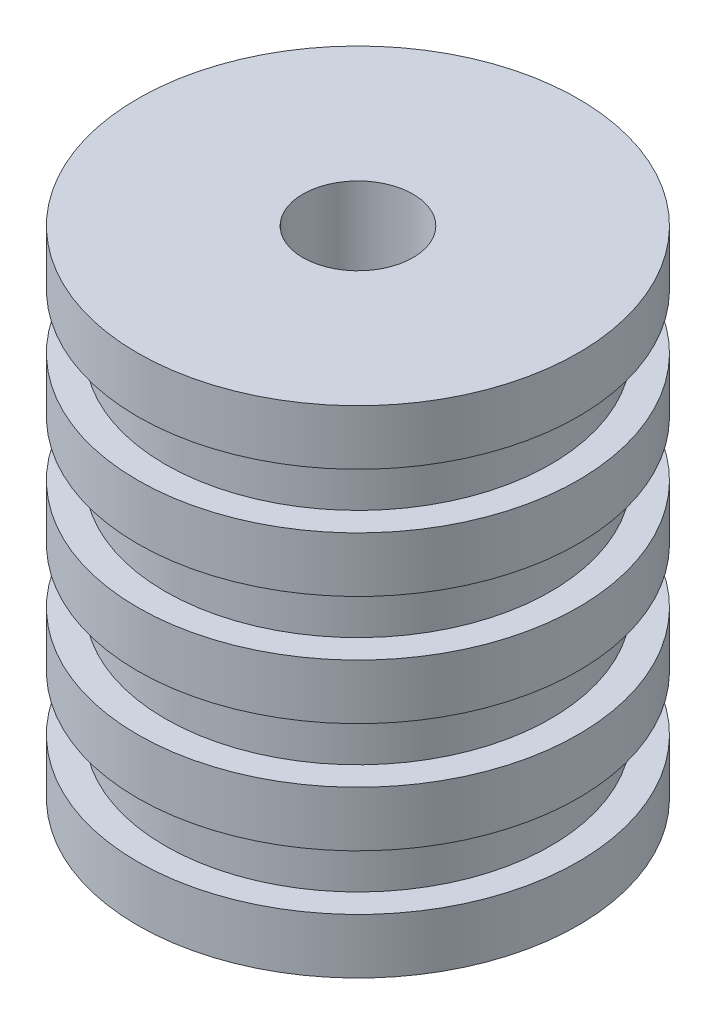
ISO-10303-21;
HEADER;
FILE_DESCRIPTION(('STEP AP214'),'2;1');
FILE_NAME('part.step','',(''),(''),'','','');
FILE_SCHEMA(('AUTOMOTIVE_DESIGN { 1 0 10303 214 1 1 1 1 }'));
ENDSEC;
DATA;
#1=APPLICATION_CONTEXT('core data for automotive mechanical design processes');
#2=APPLICATION_PROTOCOL_DEFINITION('international standard','automotive_design',2000,#1);
#3=PRODUCT_CONTEXT('',#1,'mechanical');
#4=PRODUCT('Part','Part','',(#3));
#5=PRODUCT_RELATED_PRODUCT_CATEGORY('part','',(#4));
#6=PRODUCT_DEFINITION_FORMATION('','',#4);
#7=PRODUCT_DEFINITION_CONTEXT('part definition',#1,'design');
#8=PRODUCT_DEFINITION('design','',#6,#7);
#9=PRODUCT_DEFINITION_SHAPE('','',#8);
#10=(LENGTH_UNIT() NAMED_UNIT(*) SI_UNIT(.MILLI.,.METRE.));
#11=(NAMED_UNIT(*) PLANE_ANGLE_UNIT() SI_UNIT($,.RADIAN.));
#12=(NAMED_UNIT(*) SI_UNIT($,.STERADIAN.) SOLID_ANGLE_UNIT());
#13=UNCERTAINTY_MEASURE_WITH_UNIT(LENGTH_MEASURE(1.E-05),#10,'distance_accuracy_value','');
#14=(GEOMETRIC_REPRESENTATION_CONTEXT(3) GLOBAL_UNCERTAINTY_ASSIGNED_CONTEXT((#13)) GLOBAL_UNIT_ASSIGNED_CONTEXT((#10,
#11,#12)) REPRESENTATION_CONTEXT('',''));
#15=CARTESIAN_POINT('',(0.,0.,0.));
#16=DIRECTION('',(0.,0.,1.));
#17=DIRECTION('',(1.,0.,0.));
#18=AXIS2_PLACEMENT_3D('',#15,#16,#17);
#19=CARTESIAN_POINT('',(0.,0.,0.));
#20=DIRECTION('',(0.,1.,0.));
#21=DIRECTION('',(0.,0.,1.));
#22=AXIS2_PLACEMENT_3D('',#19,#20,#21);
#23=CYLINDRICAL_SURFACE('',#22,80.);
#24=CARTESIAN_POINT('',(0.,0.,0.));
#25=DIRECTION('',(0.,1.,0.));
#26=DIRECTION('',(0.,0.,1.));
#27=AXIS2_PLACEMENT_3D('',#24,#25,#26);
#28=CIRCLE('',#27,80.);
#29=CARTESIAN_POINT('',(0.,0.,80.));
#30=VERTEX_POINT('',#29);
#31=EDGE_CURVE('E10',#30,#30,#28,.T.);
#32=ORIENTED_EDGE('',*,*,#31,.F.);
#33=EDGE_LOOP('',(#32));
#34=FACE_BOUND('',#33,.T.);
#35=CARTESIAN_POINT('',(0.,-20.,0.));
#36=DIRECTION('',(0.,1.,0.));
#37=DIRECTION('',(0.,0.,1.));
#38=AXIS2_PLACEMENT_3D('',#35,#36,#37);
#39=CIRCLE('',#38,80.);
#40=CARTESIAN_POINT('',(0.,-20.,80.));
#41=VERTEX_POINT('',#40);
#42=EDGE_CURVE('E410',#41,#41,#39,.T.);
#43=ORIENTED_EDGE('',*,*,#42,.T.);
#44=EDGE_LOOP('',(#43));
#45=FACE_BOUND('',#44,.T.);
#46=ADVANCED_FACE('F346',(#34,#45),#23,.T.);
#47=CARTESIAN_POINT('',(20.000000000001,0.,0.));
#48=DIRECTION('',(0.,-1.,0.));
#49=DIRECTION('',(0.,0.,-1.));
#50=AXIS2_PLACEMENT_3D('',#47,#48,#49);
#51=PLANE('',#50);
#52=CARTESIAN_POINT('',(0.,0.,0.));
#53=DIRECTION('',(0.,1.,0.));
#54=DIRECTION('',(0.,0.,1.));
#55=AXIS2_PLACEMENT_3D('',#52,#53,#54);
#56=CIRCLE('',#55,20.000000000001);
#57=CARTESIAN_POINT('',(0.,0.,20.000000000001));
#58=VERTEX_POINT('',#57);
#59=EDGE_CURVE('E352',#58,#58,#56,.T.);
#60=ORIENTED_EDGE('',*,*,#59,.F.);
#61=EDGE_LOOP('',(#60));
#62=FACE_BOUND('',#61,.T.);
#63=ORIENTED_EDGE('',*,*,#31,.T.);
#64=EDGE_LOOP('',(#63));
#65=FACE_BOUND('',#64,.T.);
#66=ADVANCED_FACE('F519',(#62,#65),#51,.F.);
#67=CARTESIAN_POINT('',(0.,0.,0.));
#68=DIRECTION('',(0.,1.,0.));
#69=DIRECTION('',(0.,0.,1.));
#70=AXIS2_PLACEMENT_3D('',#67,#68,#69);
#71=CYLINDRICAL_SURFACE('',#70,20.000000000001);
#72=CARTESIAN_POINT('',(0.,-180.,0.));
#73=DIRECTION('',(0.,1.,0.));
#74=DIRECTION('',(0.,0.,1.));
#75=AXIS2_PLACEMENT_3D('',#72,#73,#74);
#76=CIRCLE('',#75,20.000000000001);
#77=CARTESIAN_POINT('',(0.,-180.,20.000000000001));
#78=VERTEX_POINT('',#77);
#79=EDGE_CURVE('E356',#78,#78,#76,.T.);
#80=ORIENTED_EDGE('',*,*,#79,.F.);
#81=EDGE_LOOP('',(#80));
#82=FACE_BOUND('',#81,.T.);
#83=ORIENTED_EDGE('',*,*,#59,.T.);
#84=EDGE_LOOP('',(#83));
#85=FACE_BOUND('',#84,.T.);
#86=ADVANCED_FACE('F514',(#82,#85),#71,.F.);
#87=CARTESIAN_POINT('',(80.0000000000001,-180.,0.));
#88=DIRECTION('',(0.,1.,0.));
#89=DIRECTION('',(0.,0.,1.));
#90=AXIS2_PLACEMENT_3D('',#87,#88,#89);
#91=PLANE('',#90);
#92=CARTESIAN_POINT('',(0.,-180.,0.));
#93=DIRECTION('',(0.,1.,0.));
#94=DIRECTION('',(0.,0.,1.));
#95=AXIS2_PLACEMENT_3D('',#92,#93,#94);
#96=CIRCLE('',#95,80.0000000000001);
#97=CARTESIAN_POINT('',(0.,-180.,80.0000000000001));
#98=VERTEX_POINT('',#97);
#99=EDGE_CURVE('E360',#98,#98,#96,.T.);
#100=ORIENTED_EDGE('',*,*,#99,.F.);
#101=EDGE_LOOP('',(#100));
#102=FACE_BOUND('',#101,.T.);
#103=ORIENTED_EDGE('',*,*,#79,.T.);
#104=EDGE_LOOP('',(#103));
#105=FACE_BOUND('',#104,.T.);
#106=ADVANCED_FACE('F508',(#102,#105),#91,.F.);
#107=CARTESIAN_POINT('',(0.,0.,0.));
#108=DIRECTION('',(0.,1.,0.));
#109=DIRECTION('',(0.,0.,1.));
#110=AXIS2_PLACEMENT_3D('',#107,#108,#109);
#111=CYLINDRICAL_SURFACE('',#110,80.0000000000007);
#112=CARTESIAN_POINT('',(0.,-160.,0.));
#113=DIRECTION('',(0.,1.,0.));
#114=DIRECTION('',(0.,0.,1.));
#115=AXIS2_PLACEMENT_3D('',#112,#113,#114);
#116=CIRCLE('',#115,80.0000000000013);
#117=CARTESIAN_POINT('',(0.,-160.,80.0000000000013));
#118=VERTEX_POINT('',#117);
#119=EDGE_CURVE('E365',#118,#118,#116,.T.);
#120=ORIENTED_EDGE('',*,*,#119,.F.);
#121=EDGE_LOOP('',(#120));
#122=FACE_BOUND('',#121,.T.);
#123=ORIENTED_EDGE('',*,*,#99,.T.);
#124=EDGE_LOOP('',(#123));
#125=FACE_BOUND('',#124,.T.);
#126=ADVANCED_FACE('F502',(#122,#125),#111,.T.);
#127=CARTESIAN_POINT('',(70.0000000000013,-160.,0.));
#128=DIRECTION('',(0.,-1.,0.));
#129=DIRECTION('',(0.,0.,-1.));
#130=AXIS2_PLACEMENT_3D('',#127,#128,#129);
#131=PLANE('',#130);
#132=CARTESIAN_POINT('',(0.,-160.,0.));
#133=DIRECTION('',(0.,1.,0.));
#134=DIRECTION('',(0.,0.,1.));
#135=AXIS2_PLACEMENT_3D('',#132,#133,#134);
#136=CIRCLE('',#135,70.0000000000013);
#137=CARTESIAN_POINT('',(0.,-160.,70.0000000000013));
#138=VERTEX_POINT('',#137);
#139=EDGE_CURVE('E368',#138,#138,#136,.T.);
#140=ORIENTED_EDGE('',*,*,#139,.F.);
#141=EDGE_LOOP('',(#140));
#142=FACE_BOUND('',#141,.T.);
#143=ORIENTED_EDGE('',*,*,#119,.T.);
#144=EDGE_LOOP('',(#143));
#145=FACE_BOUND('',#144,.T.);
#146=ADVANCED_FACE('F496',(#142,#145),#131,.F.);
#147=CARTESIAN_POINT('',(0.,0.,0.));
#148=DIRECTION('',(0.,1.,0.));
#149=DIRECTION('',(0.,0.,1.));
#150=AXIS2_PLACEMENT_3D('',#147,#148,#149);
#151=CYLINDRICAL_SURFACE('',#150,70.0000000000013);
#152=CARTESIAN_POINT('',(0.,-140.,0.));
#153=DIRECTION('',(0.,1.,0.));
#154=DIRECTION('',(0.,0.,1.));
#155=AXIS2_PLACEMENT_3D('',#152,#153,#154);
#156=CIRCLE('',#155,70.0000000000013);
#157=CARTESIAN_POINT('',(0.,-140.,70.0000000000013));
#158=VERTEX_POINT('',#157);
#159=EDGE_CURVE('E371',#158,#158,#156,.T.);
#160=ORIENTED_EDGE('',*,*,#159,.F.);
#161=EDGE_LOOP('',(#160));
#162=FACE_BOUND('',#161,.T.);
#163=ORIENTED_EDGE('',*,*,#139,.T.);
#164=EDGE_LOOP('',(#163));
#165=FACE_BOUND('',#164,.T.);
#166=ADVANCED_FACE('F490',(#162,#165),#151,.T.);
#167=CARTESIAN_POINT('',(80.0000000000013,-140.,0.));
#168=DIRECTION('',(0.,1.,0.));
#169=DIRECTION('',(0.,0.,1.));
#170=AXIS2_PLACEMENT_3D('',#167,#168,#169);
#171=PLANE('',#170);
#172=CARTESIAN_POINT('',(0.,-140.,0.));
#173=DIRECTION('',(0.,1.,0.));
#174=DIRECTION('',(0.,0.,1.));
#175=AXIS2_PLACEMENT_3D('',#172,#173,#174);
#176=CIRCLE('',#175,80.0000000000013);
#177=CARTESIAN_POINT('',(0.,-140.,80.0000000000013));
#178=VERTEX_POINT('',#177);
#179=EDGE_CURVE('E374',#178,#178,#176,.T.);
#180=ORIENTED_EDGE('',*,*,#179,.F.);
#181=EDGE_LOOP('',(#180));
#182=FACE_BOUND('',#181,.T.);
#183=ORIENTED_EDGE('',*,*,#159,.T.);
#184=EDGE_LOOP('',(#183));
#185=FACE_BOUND('',#184,.T.);
#186=ADVANCED_FACE('F484',(#182,#185),#171,.F.);
#187=CARTESIAN_POINT('',(0.,0.,0.));
#188=DIRECTION('',(0.,1.,0.));
#189=DIRECTION('',(0.,0.,1.));
#190=AXIS2_PLACEMENT_3D('',#187,#188,#189);
#191=CYLINDRICAL_SURFACE('',#190,80.0000000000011);
#192=CARTESIAN_POINT('',(0.,-120.,0.));
#193=DIRECTION('',(0.,1.,0.));
#194=DIRECTION('',(0.,0.,1.));
#195=AXIS2_PLACEMENT_3D('',#192,#193,#194);
#196=CIRCLE('',#195,80.0000000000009);
#197=CARTESIAN_POINT('',(0.,-120.,80.0000000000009));
#198=VERTEX_POINT('',#197);
#199=EDGE_CURVE('E377',#198,#198,#196,.T.);
#200=ORIENTED_EDGE('',*,*,#199,.F.);
#201=EDGE_LOOP('',(#200));
#202=FACE_BOUND('',#201,.T.);
#203=ORIENTED_EDGE('',*,*,#179,.T.);
#204=EDGE_LOOP('',(#203));
#205=FACE_BOUND('',#204,.T.);
#206=ADVANCED_FACE('F478',(#202,#205),#191,.T.);
#207=CARTESIAN_POINT('',(70.0000000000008,-120.,0.));
#208=DIRECTION('',(0.,-1.,0.));
#209=DIRECTION('',(0.,0.,-1.));
#210=AXIS2_PLACEMENT_3D('',#207,#208,#209);
#211=PLANE('',#210);
#212=CARTESIAN_POINT('',(0.,-120.,0.));
#213=DIRECTION('',(0.,1.,0.));
#214=DIRECTION('',(0.,0.,1.));
#215=AXIS2_PLACEMENT_3D('',#212,#213,#214);
#216=CIRCLE('',#215,70.0000000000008);
#217=CARTESIAN_POINT('',(0.,-120.,70.0000000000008));
#218=VERTEX_POINT('',#217);
#219=EDGE_CURVE('E380',#218,#218,#216,.T.);
#220=ORIENTED_EDGE('',*,*,#219,.F.);
#221=EDGE_LOOP('',(#220));
#222=FACE_BOUND('',#221,.T.);
#223=ORIENTED_EDGE('',*,*,#199,.T.);
#224=EDGE_LOOP('',(#223));
#225=FACE_BOUND('',#224,.T.);
#226=ADVANCED_FACE('F472',(#222,#225),#211,.F.);
#227=CARTESIAN_POINT('',(0.,0.,0.));
#228=DIRECTION('',(0.,1.,0.));
#229=DIRECTION('',(0.,0.,1.));
#230=AXIS2_PLACEMENT_3D('',#227,#228,#229);
#231=CYLINDRICAL_SURFACE('',#230,70.0000000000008);
#232=CARTESIAN_POINT('',(0.,-100.,0.));
#233=DIRECTION('',(0.,1.,0.));
#234=DIRECTION('',(0.,0.,1.));
#235=AXIS2_PLACEMENT_3D('',#232,#233,#234);
#236=CIRCLE('',#235,70.0000000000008);
#237=CARTESIAN_POINT('',(0.,-100.,70.0000000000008));
#238=VERTEX_POINT('',#237);
#239=EDGE_CURVE('E383',#238,#238,#236,.T.);
#240=ORIENTED_EDGE('',*,*,#239,.F.);
#241=EDGE_LOOP('',(#240));
#242=FACE_BOUND('',#241,.T.);
#243=ORIENTED_EDGE('',*,*,#219,.T.);
#244=EDGE_LOOP('',(#243));
#245=FACE_BOUND('',#244,.T.);
#246=ADVANCED_FACE('F466',(#242,#245),#231,.T.);
#247=CARTESIAN_POINT('',(80.0000000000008,-100.,0.));
#248=DIRECTION('',(0.,1.,0.));
#249=DIRECTION('',(0.,0.,1.));
#250=AXIS2_PLACEMENT_3D('',#247,#248,#249);
#251=PLANE('',#250);
#252=CARTESIAN_POINT('',(0.,-100.,0.));
#253=DIRECTION('',(0.,1.,0.));
#254=DIRECTION('',(0.,0.,1.));
#255=AXIS2_PLACEMENT_3D('',#252,#253,#254);
#256=CIRCLE('',#255,80.0000000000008);
#257=CARTESIAN_POINT('',(0.,-100.,80.0000000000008));
#258=VERTEX_POINT('',#257);
#259=EDGE_CURVE('E386',#258,#258,#256,.T.);
#260=ORIENTED_EDGE('',*,*,#259,.F.);
#261=EDGE_LOOP('',(#260));
#262=FACE_BOUND('',#261,.T.);
#263=ORIENTED_EDGE('',*,*,#239,.T.);
#264=EDGE_LOOP('',(#263));
#265=FACE_BOUND('',#264,.T.);
#266=ADVANCED_FACE('F460',(#262,#265),#251,.F.);
#267=CARTESIAN_POINT('',(0.,0.,0.));
#268=DIRECTION('',(0.,1.,0.));
#269=DIRECTION('',(0.,0.,1.));
#270=AXIS2_PLACEMENT_3D('',#267,#268,#269);
#271=CYLINDRICAL_SURFACE('',#270,80.0000000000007);
#272=CARTESIAN_POINT('',(0.,-80.,0.));
#273=DIRECTION('',(0.,1.,0.));
#274=DIRECTION('',(0.,0.,1.));
#275=AXIS2_PLACEMENT_3D('',#272,#273,#274);
#276=CIRCLE('',#275,80.0000000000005);
#277=CARTESIAN_POINT('',(0.,-80.,80.0000000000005));
#278=VERTEX_POINT('',#277);
#279=EDGE_CURVE('E389',#278,#278,#276,.T.);
#280=ORIENTED_EDGE('',*,*,#279,.F.);
#281=EDGE_LOOP('',(#280));
#282=FACE_BOUND('',#281,.T.);
#283=ORIENTED_EDGE('',*,*,#259,.T.);
#284=EDGE_LOOP('',(#283));
#285=FACE_BOUND('',#284,.T.);
#286=ADVANCED_FACE('F454',(#282,#285),#271,.T.);
#287=CARTESIAN_POINT('',(70.0000000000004,-80.,0.));
#288=DIRECTION('',(0.,-1.,0.));
#289=DIRECTION('',(0.,0.,-1.));
#290=AXIS2_PLACEMENT_3D('',#287,#288,#289);
#291=PLANE('',#290);
#292=CARTESIAN_POINT('',(0.,-80.,0.));
#293=DIRECTION('',(0.,1.,0.));
#294=DIRECTION('',(0.,0.,1.));
#295=AXIS2_PLACEMENT_3D('',#292,#293,#294);
#296=CIRCLE('',#295,70.0000000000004);
#297=CARTESIAN_POINT('',(0.,-80.,70.0000000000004));
#298=VERTEX_POINT('',#297);
#299=EDGE_CURVE('E392',#298,#298,#296,.T.);
#300=ORIENTED_EDGE('',*,*,#299,.F.);
#301=EDGE_LOOP('',(#300));
#302=FACE_BOUND('',#301,.T.);
#303=ORIENTED_EDGE('',*,*,#279,.T.);
#304=EDGE_LOOP('',(#303));
#305=FACE_BOUND('',#304,.T.);
#306=ADVANCED_FACE('F448',(#302,#305),#291,.F.);
#307=CARTESIAN_POINT('',(0.,0.,0.));
#308=DIRECTION('',(0.,1.,0.));
#309=DIRECTION('',(0.,0.,1.));
#310=AXIS2_PLACEMENT_3D('',#307,#308,#309);
#311=CYLINDRICAL_SURFACE('',#310,70.0000000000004);
#312=CARTESIAN_POINT('',(0.,-60.,0.));
#313=DIRECTION('',(0.,1.,0.));
#314=DIRECTION('',(0.,0.,1.));
#315=AXIS2_PLACEMENT_3D('',#312,#313,#314);
#316=CIRCLE('',#315,70.0000000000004);
#317=CARTESIAN_POINT('',(0.,-60.,70.0000000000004));
#318=VERTEX_POINT('',#317);
#319=EDGE_CURVE('E395',#318,#318,#316,.T.);
#320=ORIENTED_EDGE('',*,*,#319,.F.);
#321=EDGE_LOOP('',(#320));
#322=FACE_BOUND('',#321,.T.);
#323=ORIENTED_EDGE('',*,*,#299,.T.);
#324=EDGE_LOOP('',(#323));
#325=FACE_BOUND('',#324,.T.);
#326=ADVANCED_FACE('F442',(#322,#325),#311,.T.);
#327=CARTESIAN_POINT('',(80.0000000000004,-60.,0.));
#328=DIRECTION('',(0.,1.,0.));
#329=DIRECTION('',(0.,0.,1.));
#330=AXIS2_PLACEMENT_3D('',#327,#328,#329);
#331=PLANE('',#330);
#332=CARTESIAN_POINT('',(0.,-60.,0.));
#333=DIRECTION('',(0.,1.,0.));
#334=DIRECTION('',(0.,0.,1.));
#335=AXIS2_PLACEMENT_3D('',#332,#333,#334);
#336=CIRCLE('',#335,80.0000000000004);
#337=CARTESIAN_POINT('',(0.,-60.,80.0000000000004));
#338=VERTEX_POINT('',#337);
#339=EDGE_CURVE('E398',#338,#338,#336,.T.);
#340=ORIENTED_EDGE('',*,*,#339,.F.);
#341=EDGE_LOOP('',(#340));
#342=FACE_BOUND('',#341,.T.);
#343=ORIENTED_EDGE('',*,*,#319,.T.);
#344=EDGE_LOOP('',(#343));
#345=FACE_BOUND('',#344,.T.);
#346=ADVANCED_FACE('F436',(#342,#345),#331,.F.);
#347=CARTESIAN_POINT('',(0.,0.,0.));
#348=DIRECTION('',(0.,1.,0.));
#349=DIRECTION('',(0.,0.,1.));
#350=AXIS2_PLACEMENT_3D('',#347,#348,#349);
#351=CYLINDRICAL_SURFACE('',#350,80.0000000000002);
#352=CARTESIAN_POINT('',(0.,-40.,0.));
#353=DIRECTION('',(0.,1.,0.));
#354=DIRECTION('',(0.,0.,1.));
#355=AXIS2_PLACEMENT_3D('',#352,#353,#354);
#356=CIRCLE('',#355,80.);
#357=CARTESIAN_POINT('',(0.,-40.,80.));
#358=VERTEX_POINT('',#357);
#359=EDGE_CURVE('E401',#358,#358,#356,.T.);
#360=ORIENTED_EDGE('',*,*,#359,.F.);
#361=EDGE_LOOP('',(#360));
#362=FACE_BOUND('',#361,.T.);
#363=ORIENTED_EDGE('',*,*,#339,.T.);
#364=EDGE_LOOP('',(#363));
#365=FACE_BOUND('',#364,.T.);
#366=ADVANCED_FACE('F430',(#362,#365),#351,.T.);
#367=CARTESIAN_POINT('',(70.,-40.,0.));
#368=DIRECTION('',(0.,-1.,0.));
#369=DIRECTION('',(0.,0.,-1.));
#370=AXIS2_PLACEMENT_3D('',#367,#368,#369);
#371=PLANE('',#370);
#372=CARTESIAN_POINT('',(0.,-40.,0.));
#373=DIRECTION('',(0.,1.,0.));
#374=DIRECTION('',(0.,0.,1.));
#375=AXIS2_PLACEMENT_3D('',#372,#373,#374);
#376=CIRCLE('',#375,70.);
#377=CARTESIAN_POINT('',(0.,-40.,70.));
#378=VERTEX_POINT('',#377);
#379=EDGE_CURVE('E404',#378,#378,#376,.T.);
#380=ORIENTED_EDGE('',*,*,#379,.F.);
#381=EDGE_LOOP('',(#380));
#382=FACE_BOUND('',#381,.T.);
#383=ORIENTED_EDGE('',*,*,#359,.T.);
#384=EDGE_LOOP('',(#383));
#385=FACE_BOUND('',#384,.T.);
#386=ADVANCED_FACE('F424',(#382,#385),#371,.F.);
#387=CARTESIAN_POINT('',(0.,0.,0.));
#388=DIRECTION('',(0.,1.,0.));
#389=DIRECTION('',(0.,0.,1.));
#390=AXIS2_PLACEMENT_3D('',#387,#388,#389);
#391=CYLINDRICAL_SURFACE('',#390,70.);
#392=CARTESIAN_POINT('',(0.,-20.,0.));
#393=DIRECTION('',(0.,1.,0.));
#394=DIRECTION('',(0.,0.,1.));
#395=AXIS2_PLACEMENT_3D('',#392,#393,#394);
#396=CIRCLE('',#395,70.);
#397=CARTESIAN_POINT('',(0.,-20.,70.));
#398=VERTEX_POINT('',#397);
#399=EDGE_CURVE('E407',#398,#398,#396,.T.);
#400=ORIENTED_EDGE('',*,*,#399,.F.);
#401=EDGE_LOOP('',(#400));
#402=FACE_BOUND('',#401,.T.);
#403=ORIENTED_EDGE('',*,*,#379,.T.);
#404=EDGE_LOOP('',(#403));
#405=FACE_BOUND('',#404,.T.);
#406=ADVANCED_FACE('F418',(#402,#405),#391,.T.);
#407=CARTESIAN_POINT('',(80.,-20.,0.));
#408=DIRECTION('',(0.,1.,0.));
#409=DIRECTION('',(0.,0.,1.));
#410=AXIS2_PLACEMENT_3D('',#407,#408,#409);
#411=PLANE('',#410);
#412=ORIENTED_EDGE('',*,*,#42,.F.);
#413=EDGE_LOOP('',(#412));
#414=FACE_BOUND('',#413,.T.);
#415=ORIENTED_EDGE('',*,*,#399,.T.);
#416=EDGE_LOOP('',(#415));
#417=FACE_BOUND('',#416,.T.);
#418=ADVANCED_FACE('F415',(#414,#417),#411,.F.);
#419=CLOSED_SHELL('',(#46,#66,#86,#106,#126,#146,#166,#186,#206,#226,#246,#266,#286,#306,#326,
#346,#366,#386,#406,#418));
#420=MANIFOLD_SOLID_BREP('B2',#419);
#421=ADVANCED_BREP_SHAPE_REPRESENTATION('',(#18,#420),#14);
#422=SHAPE_DEFINITION_REPRESENTATION(#9,#421);
ENDSEC;
END-ISO-10303-21;
